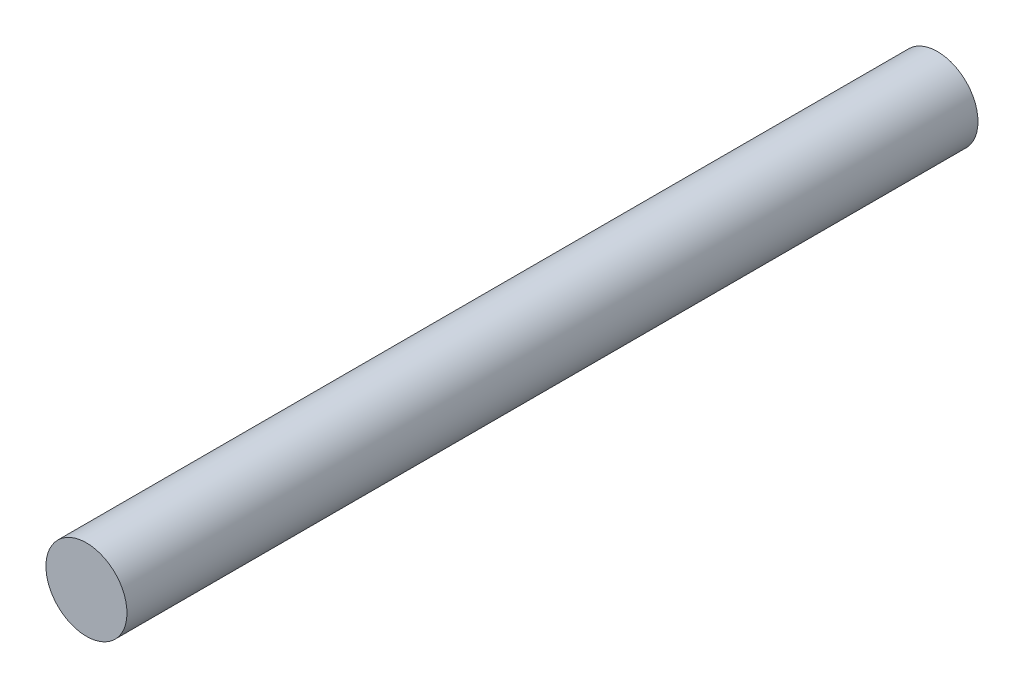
from build123d import *

# Parameters (mm, degrees)
ESTRUSIONE_ESTRUSIONE1_DEPTH      = 85
ESTRUSIONE_ESTRUSIONE1_DEPTH_BACK = 20
SCHIZZO1_R                        = 5


with BuildPart() as part:
    # Schizzo1 → Estrusione-Estrusione1 (new, two sides: drawn at the far end of the back side and taken through both)
    with BuildSketch(Plane.XY.offset(-ESTRUSIONE_ESTRUSIONE1_DEPTH_BACK)):
        Circle(SCHIZZO1_R)
    extrude(amount=ESTRUSIONE_ESTRUSIONE1_DEPTH + ESTRUSIONE_ESTRUSIONE1_DEPTH_BACK)

    # Schizzo3 → Foro filettato M6-1 (revolve, cut)
    with BuildSketch(Plane(origin=(0, 0, -20), x_dir=(0, 1, 0), z_dir=(1, 0, 0))):
        Polygon((0, 0), (0, 17), (2.5, 15.497848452), (2.5, 0), align=None)
    revolve(axis=Axis((0, 0, -26.35), (0, 0, 1)), mode=Mode.SUBTRACT)


solid = part.part
